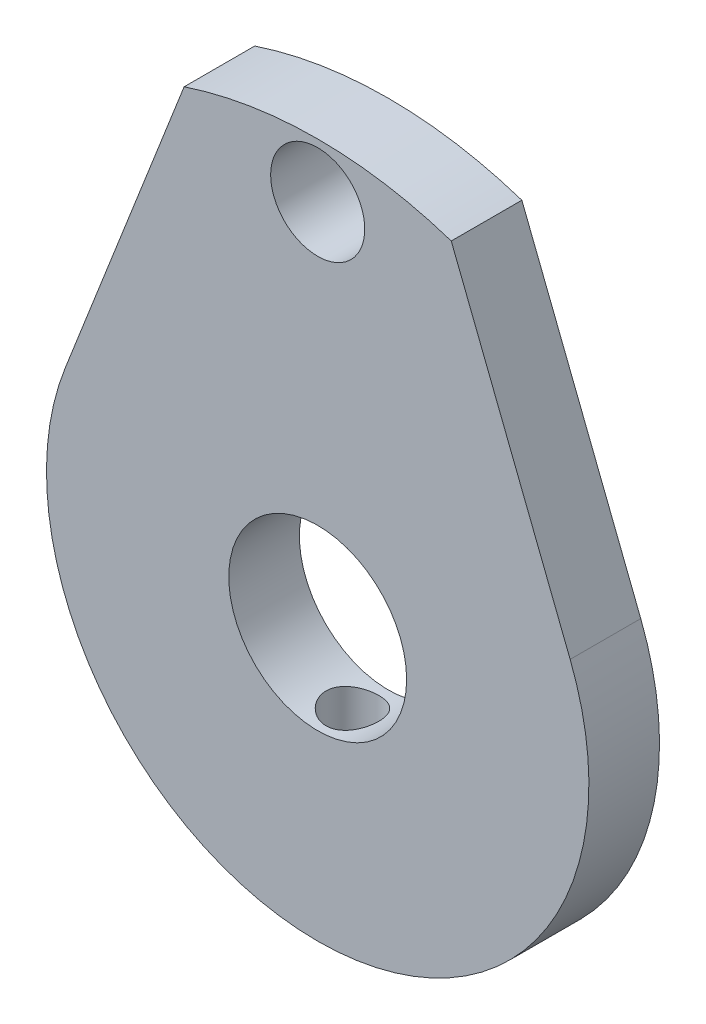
from build123d import *

# Parameters (mm, degrees)
SKETCH1_R                  = 14.2875
EXTRUDE1_DEPTH             = 2.38125
SKETCH2_R                  = 1.5875
CUT_EXTRUDE1_DEPTH         = 21.345408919
SKETCH4_OUTSIDE_W          = 38.672
SKETCH4_OUTSIDE_H          = 38.672
CUT_EXTRUDE3_DEPTH         = 21.345408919
SKETCH8_R                  = 2.999994
CUT_EXTRUDE5_DEPTH         = 18.131362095
SKETCH9_R                  = 0.889
CUT_EXTRUDE7_DEPTH         = 0.254
F_2_56_TAPPED_HOLE1_REACH  = 26.95
F_2_56_TAPPED_HOLE1_BORE_R = 0.889


with BuildPart() as part:
    # Sketch1 → Extrude1 (new body)
    with BuildSketch(Plane.XY):
        with Locations(Location((0, 0, 0), (0, 0, 180))):
            Circle(SKETCH1_R)
    extrude(amount=EXTRUDE1_DEPTH)

    # Sketch2 → Cut-Extrude1 (cut, through all)
    with BuildSketch(Plane(origin=(0, 0, 0), x_dir=(-1, 0, 0), z_dir=(0, 0, -1))):
        with Locations((0, 12.446)):
            Circle(SKETCH2_R)
    extrude(amount=-CUT_EXTRUDE1_DEPTH, mode=Mode.SUBTRACT)

    # Sketch4 outside → Cut-Extrude3 (cut, through all)
    with BuildSketch(Plane.XY.offset(2.38125)):
        Rectangle(SKETCH4_OUTSIDE_W, SKETCH4_OUTSIDE_H)
        with BuildLine():
            Line((-4.5047477, 13.55875748), (-8.515121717, 3.342642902))
            ThreePointArc((-8.515121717, 3.342642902), (0, -9.147707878), (8.515121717, 3.342642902))
            Line((8.515121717, 3.342642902), (4.5047477, 13.55875748))
            ThreePointArc((4.5047477, 13.55875748), (0, 14.2875), (-4.5047477, 13.55875748))
        make_face(mode=Mode.SUBTRACT)
    extrude(amount=-CUT_EXTRUDE3_DEPTH, mode=Mode.SUBTRACT)

    # Sketch8 → Cut-Extrude5 (cut, through all)
    with BuildSketch(Plane.XY.offset(2.38125)):
        Circle(SKETCH8_R)
    extrude(amount=-CUT_EXTRUDE5_DEPTH, mode=Mode.SUBTRACT)

    # Sketch9 → Cut-Extrude7 (cut)
    with BuildSketch(Plane(origin=(0, -9.147707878, 0), x_dir=(-1, 0, 0), z_dir=(0, 1, 0))):
        with Locations(Location((0, 1.207766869, 0), (0, 0, 270))):
            Circle(SKETCH9_R)
    extrude(amount=CUT_EXTRUDE7_DEPTH, mode=Mode.SUBTRACT)

    # 2-56 Tapped Hole1 bore (on position points) → 2-56 Tapped Hole1 (cut, up to next)
    with BuildSketch(Plane(origin=(0, -8.893707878, 1.207766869), x_dir=(0, 0, -1), z_dir=(0, -1, 0)), mode=Mode.PRIVATE) as f_2_56_tapped_hole1_sk1:
        Circle(F_2_56_TAPPED_HOLE1_BORE_R)
    f_2_56_tapped_hole1_tool1 = extrude(f_2_56_tapped_hole1_sk1.sketch, amount=-F_2_56_TAPPED_HOLE1_REACH, mode=Mode.PRIVATE) & part.part
    add(f_2_56_tapped_hole1_tool1.solids().sort_by_distance((0, -8.893708, 1.207767))[0], mode=Mode.SUBTRACT)


solid = part.part
